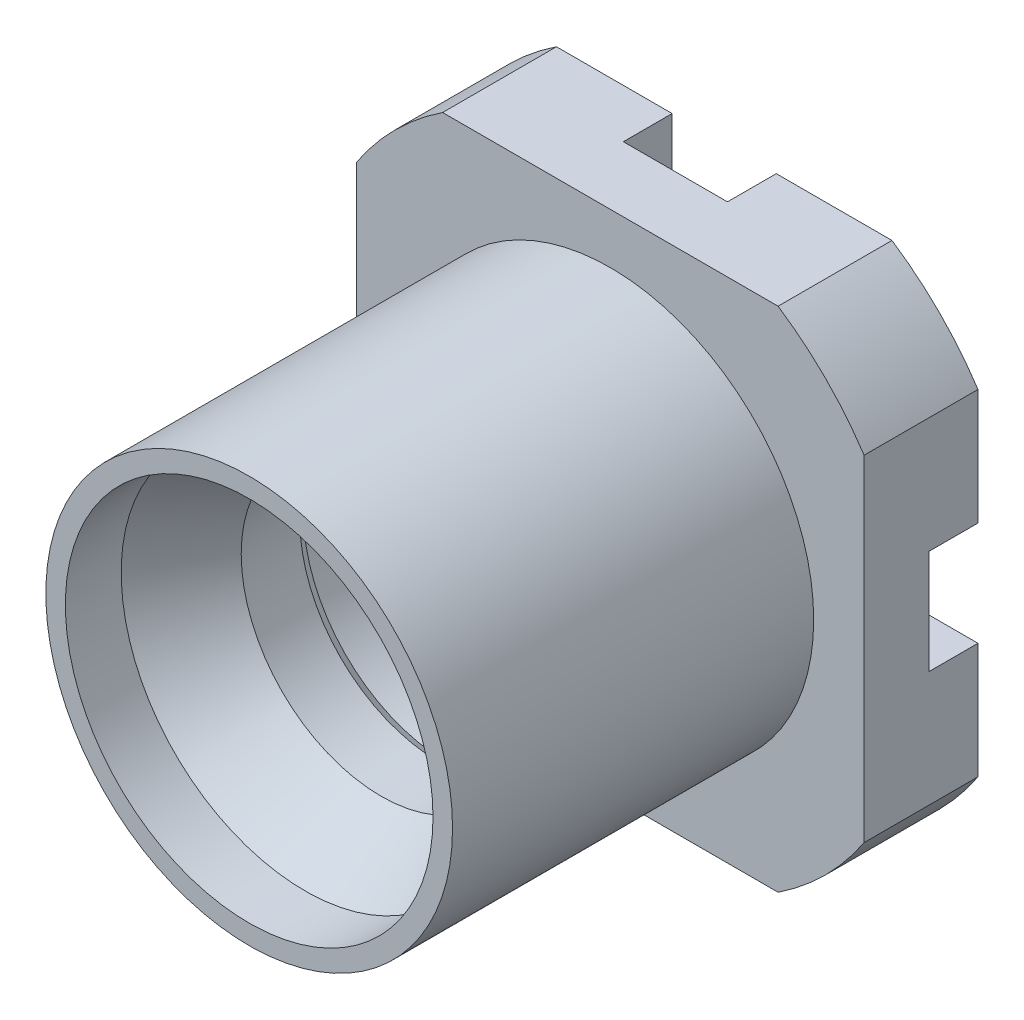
ISO-10303-21;
HEADER;
FILE_DESCRIPTION(('STEP AP214'),'2;1');
FILE_NAME('part.step','',(''),(''),'','','');
FILE_SCHEMA(('AUTOMOTIVE_DESIGN { 1 0 10303 214 1 1 1 1 }'));
ENDSEC;
DATA;
#1=APPLICATION_CONTEXT('core data for automotive mechanical design processes');
#2=APPLICATION_PROTOCOL_DEFINITION('international standard','automotive_design',2000,#1);
#3=PRODUCT_CONTEXT('',#1,'mechanical');
#4=PRODUCT('Part','Part','',(#3));
#5=PRODUCT_RELATED_PRODUCT_CATEGORY('part','',(#4));
#6=PRODUCT_DEFINITION_FORMATION('','',#4);
#7=PRODUCT_DEFINITION_CONTEXT('part definition',#1,'design');
#8=PRODUCT_DEFINITION('design','',#6,#7);
#9=PRODUCT_DEFINITION_SHAPE('','',#8);
#10=(LENGTH_UNIT() NAMED_UNIT(*) SI_UNIT(.MILLI.,.METRE.));
#11=(NAMED_UNIT(*) PLANE_ANGLE_UNIT() SI_UNIT($,.RADIAN.));
#12=(NAMED_UNIT(*) SI_UNIT($,.STERADIAN.) SOLID_ANGLE_UNIT());
#13=UNCERTAINTY_MEASURE_WITH_UNIT(LENGTH_MEASURE(1.E-05),#10,'distance_accuracy_value','');
#14=(GEOMETRIC_REPRESENTATION_CONTEXT(3) GLOBAL_UNCERTAINTY_ASSIGNED_CONTEXT((#13)) GLOBAL_UNIT_ASSIGNED_CONTEXT((#10,
#11,#12)) REPRESENTATION_CONTEXT('',''));
#15=CARTESIAN_POINT('',(0.,0.,0.));
#16=DIRECTION('',(0.,0.,1.));
#17=DIRECTION('',(1.,0.,0.));
#18=AXIS2_PLACEMENT_3D('',#15,#16,#17);
#19=CARTESIAN_POINT('',(-3.86493853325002,-0.419389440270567,-0.0934486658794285));
#20=CARTESIAN_POINT('',(-3.56013853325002,-0.419389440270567,-0.0934486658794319));
#21=CARTESIAN_POINT('',(-3.56013853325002,-0.419389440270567,-0.398248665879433));
#22=CARTESIAN_POINT('',(-3.86493853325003,-0.419389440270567,-0.398248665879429));
#23=(BOUNDED_CURVE() B_SPLINE_CURVE(3,(#19,#20,#21,#22),.UNSPECIFIED.,.F.,
.F.) B_SPLINE_CURVE_WITH_KNOTS((4,4),(0.,1.),
.UNSPECIFIED.) CURVE() GEOMETRIC_REPRESENTATION_ITEM() RATIONAL_B_SPLINE_CURVE((1.,
0.333333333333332,0.333333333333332,1.)) REPRESENTATION_ITEM(''));
#24=CARTESIAN_POINT('',(-3.8649385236,-0.4193894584,-0.2458486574));
#25=DIRECTION('',(0.,0.,1.));
#26=AXIS1_PLACEMENT('',#24,#25);
#27=SURFACE_OF_REVOLUTION('',#23,#26);
#28=CARTESIAN_POINT('',(-3.86493853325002,-0.419389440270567,-0.0934486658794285));
#29=VERTEX_POINT('',#28);
#30=VERTEX_LOOP('',#29);
#31=FACE_BOUND('',#30,.T.);
#32=CARTESIAN_POINT('',(-3.8649385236,-0.4193894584,-0.245848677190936));
#33=DIRECTION('',(0.,0.,-1.));
#34=DIRECTION('',(-1.,0.,0.));
#35=AXIS2_PLACEMENT_3D('',#32,#33,#34);
#36=CIRCLE('',#35,0.1524);
#37=CARTESIAN_POINT('',(-4.0173385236,-0.4193894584,-0.245848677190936));
#38=VERTEX_POINT('',#37);
#39=EDGE_CURVE('E237',#38,#38,#36,.T.);
#40=ORIENTED_EDGE('',*,*,#39,.F.);
#41=EDGE_LOOP('',(#40));
#42=FACE_BOUND('',#41,.T.);
#43=ADVANCED_FACE('F16',(#31,#42),#27,.F.);
#44=CARTESIAN_POINT('',(-3.8649385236,-0.4193894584,-1.0967486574));
#45=DIRECTION('',(0.,0.,-1.));
#46=DIRECTION('',(-1.,0.,0.));
#47=AXIS2_PLACEMENT_3D('',#44,#45,#46);
#48=CYLINDRICAL_SURFACE('',#47,0.1524);
#49=ORIENTED_EDGE('',*,*,#39,.T.);
#50=EDGE_LOOP('',(#49));
#51=FACE_BOUND('',#50,.T.);
#52=CARTESIAN_POINT('',(-3.8649385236,-0.4193894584,-1.0967486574));
#53=DIRECTION('',(0.,0.,-1.));
#54=DIRECTION('',(-1.,0.,0.));
#55=AXIS2_PLACEMENT_3D('',#52,#53,#54);
#56=CIRCLE('',#55,0.1524);
#57=CARTESIAN_POINT('',(-4.0173385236,-0.4193894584,-1.0967486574));
#58=VERTEX_POINT('',#57);
#59=EDGE_CURVE('E20',#58,#58,#56,.T.);
#60=ORIENTED_EDGE('',*,*,#59,.F.);
#61=EDGE_LOOP('',(#60));
#62=FACE_BOUND('',#61,.T.);
#63=ADVANCED_FACE('F971',(#51,#62),#48,.T.);
#64=CARTESIAN_POINT('',(-3.8649385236,-0.2669894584,-1.0967486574));
#65=DIRECTION('',(0.,0.,-1.));
#66=DIRECTION('',(-1.,0.,0.));
#67=AXIS2_PLACEMENT_3D('',#64,#65,#66);
#68=PLANE('',#67);
#69=ORIENTED_EDGE('',*,*,#59,.T.);
#70=EDGE_LOOP('',(#69));
#71=FACE_BOUND('',#70,.T.);
#72=CARTESIAN_POINT('',(-3.8649385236,-0.4193894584,-1.0967486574));
#73=DIRECTION('',(0.,0.,1.));
#74=DIRECTION('',(1.,0.,0.));
#75=AXIS2_PLACEMENT_3D('',#72,#73,#74);
#76=CIRCLE('',#75,0.5334);
#77=CARTESIAN_POINT('',(-3.3315385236,-0.4193894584,-1.0967486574));
#78=VERTEX_POINT('',#77);
#79=EDGE_CURVE('E232',#78,#78,#76,.F.);
#80=ORIENTED_EDGE('',*,*,#79,.F.);
#81=EDGE_LOOP('',(#80));
#82=FACE_BOUND('',#81,.T.);
#83=ADVANCED_FACE('F460',(#71,#82),#68,.F.);
#84=CARTESIAN_POINT('',(-3.8649385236,-0.4193894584,-1.0967486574));
#85=DIRECTION('',(0.,0.,1.));
#86=DIRECTION('',(1.,0.,0.));
#87=AXIS2_PLACEMENT_3D('',#84,#85,#86);
#88=CONICAL_SURFACE('',#87,0.5334,0.785398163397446);
#89=ORIENTED_EDGE('',*,*,#79,.T.);
#90=EDGE_LOOP('',(#89));
#91=FACE_BOUND('',#90,.T.);
#92=CARTESIAN_POINT('',(-3.8649385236,-0.4193894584,-1.04594866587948));
#93=DIRECTION('',(0.,0.,1.));
#94=DIRECTION('',(1.,0.,0.));
#95=AXIS2_PLACEMENT_3D('',#92,#93,#94);
#96=CIRCLE('',#95,0.584199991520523);
#97=CARTESIAN_POINT('',(-3.28073853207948,-0.4193894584,-1.04594866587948));
#98=VERTEX_POINT('',#97);
#99=EDGE_CURVE('E230',#98,#98,#96,.F.);
#100=ORIENTED_EDGE('',*,*,#99,.F.);
#101=EDGE_LOOP('',(#100));
#102=FACE_BOUND('',#101,.T.);
#103=ADVANCED_FACE('F453',(#91,#102),#88,.F.);
#104=CARTESIAN_POINT('',(-3.8649385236,0.6855105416,-1.0459486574));
#105=DIRECTION('',(0.,0.,-1.));
#106=DIRECTION('',(-1.,0.,0.));
#107=AXIS2_PLACEMENT_3D('',#104,#105,#106);
#108=PLANE('',#107);
#109=ORIENTED_EDGE('',*,*,#99,.T.);
#110=EDGE_LOOP('',(#109));
#111=FACE_BOUND('',#110,.T.);
#112=CARTESIAN_POINT('',(-3.8649385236,-0.4193894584,-1.0459486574));
#113=DIRECTION('',(0.,0.,-1.));
#114=DIRECTION('',(-1.,0.,0.));
#115=AXIS2_PLACEMENT_3D('',#112,#113,#114);
#116=CIRCLE('',#115,1.1303);
#117=CARTESIAN_POINT('',(-4.9952385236,-0.4193894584,-1.0459486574));
#118=VERTEX_POINT('',#117);
#119=EDGE_CURVE('E226',#118,#118,#116,.T.);
#120=ORIENTED_EDGE('',*,*,#119,.F.);
#121=EDGE_LOOP('',(#120));
#122=FACE_BOUND('',#121,.T.);
#123=ADVANCED_FACE('F448',(#111,#122),#108,.F.);
#124=CARTESIAN_POINT('',(-3.8649385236,-0.4193894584,-0.491107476));
#125=DIRECTION('',(0.,0.,-1.));
#126=DIRECTION('',(-1.,0.,0.));
#127=AXIS2_PLACEMENT_3D('',#124,#125,#126);
#128=CYLINDRICAL_SURFACE('',#127,1.1303);
#129=CARTESIAN_POINT('',(-3.8649385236,-0.4193894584,-0.491107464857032));
#130=DIRECTION('',(0.,0.,-1.));
#131=DIRECTION('',(-1.,0.,0.));
#132=AXIS2_PLACEMENT_3D('',#129,#130,#131);
#133=CIRCLE('',#132,1.13029999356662);
#134=CARTESIAN_POINT('',(-4.99523851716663,-0.4193894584,-0.491107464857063));
#135=VERTEX_POINT('',#134);
#136=EDGE_CURVE('E229',#135,#135,#133,.T.);
#137=ORIENTED_EDGE('',*,*,#136,.F.);
#138=EDGE_LOOP('',(#137));
#139=FACE_BOUND('',#138,.T.);
#140=ORIENTED_EDGE('',*,*,#119,.T.);
#141=EDGE_LOOP('',(#140));
#142=FACE_BOUND('',#141,.T.);
#143=ADVANCED_FACE('F445',(#139,#142),#128,.F.);
#144=CARTESIAN_POINT('',(-3.8649385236,-0.4193894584,-0.4251163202));
#145=DIRECTION('',(0.,0.,-1.));
#146=DIRECTION('',(0.,1.,0.));
#147=AXIS2_PLACEMENT_3D('',#144,#145,#146);
#148=CONICAL_SURFACE('',#147,1.0922,0.523598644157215);
#149=CARTESIAN_POINT('',(-3.8649385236,-0.4193894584,-0.425116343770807));
#150=DIRECTION('',(0.,0.,-1.));
#151=DIRECTION('',(-1.,0.,0.));
#152=AXIS2_PLACEMENT_3D('',#149,#150,#151);
#153=CIRCLE('',#152,1.0922);
#154=CARTESIAN_POINT('',(-4.9571385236,-0.4193894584,-0.425116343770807));
#155=VERTEX_POINT('',#154);
#156=EDGE_CURVE('E434',#155,#155,#153,.T.);
#157=ORIENTED_EDGE('',*,*,#156,.F.);
#158=EDGE_LOOP('',(#157));
#159=FACE_BOUND('',#158,.T.);
#160=ORIENTED_EDGE('',*,*,#136,.T.);
#161=EDGE_LOOP('',(#160));
#162=FACE_BOUND('',#161,.T.);
#163=ADVANCED_FACE('F443',(#159,#162),#148,.F.);
#164=CARTESIAN_POINT('',(-3.8649385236,-0.4193894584,0.032381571));
#165=DIRECTION('',(0.,0.,-1.));
#166=DIRECTION('',(0.,1.,0.));
#167=AXIS2_PLACEMENT_3D('',#164,#165,#166);
#168=CYLINDRICAL_SURFACE('',#167,1.0922);
#169=ORIENTED_EDGE('',*,*,#156,.T.);
#170=EDGE_LOOP('',(#169));
#171=FACE_BOUND('',#170,.T.);
#172=CARTESIAN_POINT('',(-3.8649385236,-0.4193894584,0.0323815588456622));
#173=DIRECTION('',(0.,0.,1.));
#174=DIRECTION('',(1.,0.,0.));
#175=AXIS2_PLACEMENT_3D('',#172,#173,#174);
#176=CIRCLE('',#175,1.09219999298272);
#177=CARTESIAN_POINT('',(-2.77273853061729,-0.4193894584,0.0323815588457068));
#178=VERTEX_POINT('',#177);
#179=EDGE_CURVE('E429',#178,#178,#176,.F.);
#180=ORIENTED_EDGE('',*,*,#179,.F.);
#181=EDGE_LOOP('',(#180));
#182=FACE_BOUND('',#181,.T.);
#183=ADVANCED_FACE('F592',(#171,#182),#168,.F.);
#184=CARTESIAN_POINT('',(-3.8649385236,-0.4193894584,0.032381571));
#185=DIRECTION('',(0.,0.,1.));
#186=DIRECTION('',(0.,-1.,0.));
#187=AXIS2_PLACEMENT_3D('',#184,#185,#186);
#188=CONICAL_SURFACE('',#187,1.0922,0.523598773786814);
#189=ORIENTED_EDGE('',*,*,#179,.T.);
#190=EDGE_LOOP('',(#189));
#191=FACE_BOUND('',#190,.T.);
#192=CARTESIAN_POINT('',(-3.8649385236,-0.4193894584,0.62630177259));
#193=DIRECTION('',(0.,0.,1.));
#194=DIRECTION('',(1.,0.,0.));
#195=AXIS2_PLACEMENT_3D('',#192,#193,#194);
#196=CIRCLE('',#195,1.4351);
#197=CARTESIAN_POINT('',(-2.4298385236,-0.4193894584,0.62630177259));
#198=VERTEX_POINT('',#197);
#199=EDGE_CURVE('E225',#198,#198,#196,.F.);
#200=ORIENTED_EDGE('',*,*,#199,.F.);
#201=EDGE_LOOP('',(#200));
#202=FACE_BOUND('',#201,.T.);
#203=ADVANCED_FACE('F588',(#191,#202),#188,.F.);
#204=CARTESIAN_POINT('',(-3.8649385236,-0.4193894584,0.6263017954));
#205=DIRECTION('',(0.,0.,1.));
#206=DIRECTION('',(1.,0.,0.));
#207=AXIS2_PLACEMENT_3D('',#204,#205,#206);
#208=CYLINDRICAL_SURFACE('',#207,1.4351);
#209=ORIENTED_EDGE('',*,*,#199,.T.);
#210=EDGE_LOOP('',(#209));
#211=FACE_BOUND('',#210,.T.);
#212=CARTESIAN_POINT('',(-3.8649385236,-0.4193894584,1.0622513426));
#213=DIRECTION('',(0.,0.,1.));
#214=DIRECTION('',(1.,0.,0.));
#215=AXIS2_PLACEMENT_3D('',#212,#213,#214);
#216=CIRCLE('',#215,1.4351);
#217=CARTESIAN_POINT('',(-2.4298385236,-0.4193894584,1.0622513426));
#218=VERTEX_POINT('',#217);
#219=EDGE_CURVE('E221',#218,#218,#216,.F.);
#220=ORIENTED_EDGE('',*,*,#219,.F.);
#221=EDGE_LOOP('',(#220));
#222=FACE_BOUND('',#221,.T.);
#223=ADVANCED_FACE('F584',(#211,#222),#208,.F.);
#224=CARTESIAN_POINT('',(-3.8649385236,1.0157105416,1.0622513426));
#225=DIRECTION('',(0.,0.,-1.));
#226=DIRECTION('',(-1.,0.,0.));
#227=AXIS2_PLACEMENT_3D('',#224,#225,#226);
#228=PLANE('',#227);
#229=ORIENTED_EDGE('',*,*,#219,.T.);
#230=EDGE_LOOP('',(#229));
#231=FACE_BOUND('',#230,.T.);
#232=CARTESIAN_POINT('',(-3.8649385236,-0.4193894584,1.0622513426));
#233=DIRECTION('',(0.,0.,1.));
#234=DIRECTION('',(1.,0.,0.));
#235=AXIS2_PLACEMENT_3D('',#232,#233,#234);
#236=CIRCLE('',#235,1.5875);
#237=CARTESIAN_POINT('',(-2.2774385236,-0.4193894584,1.0622513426));
#238=VERTEX_POINT('',#237);
#239=EDGE_CURVE('E217',#238,#238,#236,.F.);
#240=ORIENTED_EDGE('',*,*,#239,.F.);
#241=EDGE_LOOP('',(#240));
#242=FACE_BOUND('',#241,.T.);
#243=ADVANCED_FACE('F580',(#231,#242),#228,.F.);
#244=CARTESIAN_POINT('',(-4.0554385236,-0.2318767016,-2.5826486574));
#245=DIRECTION('',(0.,0.,1.));
#246=DIRECTION('',(1.,0.,0.));
#247=AXIS2_PLACEMENT_3D('',#244,#245,#246);
#248=PLANE('',#247);
#249=CARTESIAN_POINT('',(-3.8649385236,-0.4193894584,-2.58264867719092));
#250=DIRECTION('',(0.,0.,-1.));
#251=DIRECTION('',(-1.,0.,0.));
#252=AXIS2_PLACEMENT_3D('',#249,#250,#251);
#253=CIRCLE('',#252,0.1524);
#254=CARTESIAN_POINT('',(-4.0173385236,-0.4193894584,-2.58264867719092));
#255=VERTEX_POINT('',#254);
#256=EDGE_CURVE('E209',#255,#255,#253,.F.);
#257=ORIENTED_EDGE('',*,*,#256,.F.);
#258=EDGE_LOOP('',(#257));
#259=FACE_BOUND('',#258,.T.);
#260=ADVANCED_FACE('F576',(#259),#248,.F.);
#261=CARTESIAN_POINT('',(-3.8649385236,-0.4193894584,-1.7571486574));
#262=DIRECTION('',(0.,0.,1.));
#263=DIRECTION('',(0.,-1.,0.));
#264=AXIS2_PLACEMENT_3D('',#261,#262,#263);
#265=CYLINDRICAL_SURFACE('',#264,2.3749);
#266=CARTESIAN_POINT('',(-3.8649385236,-0.4193894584,-2.64614867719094));
#267=DIRECTION('',(0.,0.,1.));
#268=DIRECTION('',(0.,-1.,0.));
#269=AXIS2_PLACEMENT_3D('',#266,#267,#268);
#270=CIRCLE('',#269,2.3749);
#271=CARTESIAN_POINT('',(-1.8837385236,-1.72896822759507,-2.64614866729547));
#272=VERTEX_POINT('',#271);
#273=CARTESIAN_POINT('',(-2.55535975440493,-2.4005894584,-2.64614866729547));
#274=VERTEX_POINT('',#273);
#275=EDGE_CURVE('E213',#272,#274,#270,.F.);
#276=ORIENTED_EDGE('',*,*,#275,.F.);
#277=DIRECTION('',(0.,0.,1.));
#278=VECTOR('',#277,1.);
#279=CARTESIAN_POINT('',(-1.8837385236,-1.728968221,-2.2651486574));
#280=LINE('',#279,#278);
#281=CARTESIAN_POINT('',(-1.8837385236,-1.72896822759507,-1.75714866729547));
#282=VERTEX_POINT('',#281);
#283=EDGE_CURVE('E224',#282,#272,#280,.F.);
#284=ORIENTED_EDGE('',*,*,#283,.F.);
#285=CARTESIAN_POINT('',(-3.8649385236,-0.4193894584,-1.75714867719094));
#286=DIRECTION('',(0.,0.,1.));
#287=DIRECTION('',(0.,-1.,0.));
#288=AXIS2_PLACEMENT_3D('',#285,#286,#287);
#289=CIRCLE('',#288,2.3749);
#290=CARTESIAN_POINT('',(-2.55535975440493,-2.4005894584,-1.75714866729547));
#291=VERTEX_POINT('',#290);
#292=EDGE_CURVE('E318',#291,#282,#289,.T.);
#293=ORIENTED_EDGE('',*,*,#292,.F.);
#294=DIRECTION('',(0.,0.,1.));
#295=VECTOR('',#294,1.);
#296=CARTESIAN_POINT('',(-2.555359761,-2.4005894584,-2.2651486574));
#297=LINE('',#296,#295);
#298=EDGE_CURVE('E220',#274,#291,#297,.T.);
#299=ORIENTED_EDGE('',*,*,#298,.F.);
#300=EDGE_LOOP('',(#276,#284,#293,#299));
#301=FACE_BOUND('',#300,.T.);
#302=ADVANCED_FACE('F573',(#301),#265,.T.);
#303=CARTESIAN_POINT('',(-1.8837385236,0.8901893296,-2.2651486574));
#304=DIRECTION('',(-1.,0.,0.));
#305=DIRECTION('',(0.,0.,1.));
#306=AXIS2_PLACEMENT_3D('',#303,#304,#305);
#307=PLANE('',#306);
#308=DIRECTION('',(0.,1.,0.));
#309=VECTOR('',#308,1.);
#310=CARTESIAN_POINT('',(-1.8837385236,-0.4193894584,-2.6461486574));
#311=LINE('',#310,#309);
#312=CARTESIAN_POINT('',(-1.88373852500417,0.890189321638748,-2.64614866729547));
#313=VERTEX_POINT('',#312);
#314=CARTESIAN_POINT('',(-1.8837385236,-0.0129894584,-2.6461486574));
#315=VERTEX_POINT('',#314);
#316=EDGE_CURVE('E197',#313,#315,#311,.F.);
#317=ORIENTED_EDGE('',*,*,#316,.F.);
#318=DIRECTION('',(0.,0.,-1.));
#319=VECTOR('',#318,1.);
#320=CARTESIAN_POINT('',(-1.88373852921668,0.890189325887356,-2.2016486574));
#321=LINE('',#320,#319);
#322=CARTESIAN_POINT('',(-1.88373852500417,0.890189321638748,-1.75714866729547));
#323=VERTEX_POINT('',#322);
#324=EDGE_CURVE('E183',#323,#313,#321,.T.);
#325=ORIENTED_EDGE('',*,*,#324,.F.);
#326=DIRECTION('',(0.,1.,0.));
#327=VECTOR('',#326,1.);
#328=CARTESIAN_POINT('',(-1.8837385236,-0.4193894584,-1.7571486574));
#329=LINE('',#328,#327);
#330=EDGE_CURVE('E317',#282,#323,#329,.T.);
#331=ORIENTED_EDGE('',*,*,#330,.F.);
#332=ORIENTED_EDGE('',*,*,#283,.T.);
#333=DIRECTION('',(0.,1.,0.));
#334=VECTOR('',#333,1.);
#335=CARTESIAN_POINT('',(-1.8837385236,-0.4193894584,-2.6461486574));
#336=LINE('',#335,#334);
#337=CARTESIAN_POINT('',(-1.8837385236,-0.8257894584,-2.6461486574));
#338=VERTEX_POINT('',#337);
#339=EDGE_CURVE('E203',#338,#272,#336,.F.);
#340=ORIENTED_EDGE('',*,*,#339,.F.);
#341=DIRECTION('',(0.,0.,1.));
#342=VECTOR('',#341,1.);
#343=CARTESIAN_POINT('',(-1.8837385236,-0.825789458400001,-2.2651486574));
#344=LINE('',#343,#342);
#345=CARTESIAN_POINT('',(-1.8837385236,-0.825789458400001,-2.2651486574));
#346=VERTEX_POINT('',#345);
#347=EDGE_CURVE('E380',#338,#346,#344,.T.);
#348=ORIENTED_EDGE('',*,*,#347,.T.);
#349=DIRECTION('',(0.,1.,0.));
#350=VECTOR('',#349,1.);
#351=CARTESIAN_POINT('',(-1.8837385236,0.8901893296,-2.2651486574));
#352=LINE('',#351,#350);
#353=CARTESIAN_POINT('',(-1.8837385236,-0.0129894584,-2.2651486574));
#354=VERTEX_POINT('',#353);
#355=EDGE_CURVE('E387',#346,#354,#352,.T.);
#356=ORIENTED_EDGE('',*,*,#355,.T.);
#357=DIRECTION('',(0.,0.,1.));
#358=VECTOR('',#357,1.);
#359=CARTESIAN_POINT('',(-1.8837385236,-0.0129894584,-2.2651486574));
#360=LINE('',#359,#358);
#361=EDGE_CURVE('E194',#354,#315,#360,.F.);
#362=ORIENTED_EDGE('',*,*,#361,.T.);
#363=EDGE_LOOP('',(#317,#325,#331,#332,#340,#348,#356,#362));
#364=FACE_BOUND('',#363,.T.);
#365=ADVANCED_FACE('F198',(#364),#307,.F.);
#366=CARTESIAN_POINT('',(-3.8649385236,-0.4193894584,-1.7571486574));
#367=DIRECTION('',(0.,0.,1.));
#368=DIRECTION('',(0.,-1.,0.));
#369=AXIS2_PLACEMENT_3D('',#366,#367,#368);
#370=CYLINDRICAL_SURFACE('',#369,2.3749);
#371=CARTESIAN_POINT('',(-3.8649385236,-0.4193894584,-2.64614867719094));
#372=DIRECTION('',(0.,0.,1.));
#373=DIRECTION('',(0.,-1.,0.));
#374=AXIS2_PLACEMENT_3D('',#371,#372,#373);
#375=CIRCLE('',#374,2.3749);
#376=CARTESIAN_POINT('',(-2.55535975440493,1.5618105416,-2.64614866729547));
#377=VERTEX_POINT('',#376);
#378=EDGE_CURVE('E187',#377,#313,#375,.F.);
#379=ORIENTED_EDGE('',*,*,#378,.F.);
#380=DIRECTION('',(0.,0.,-1.));
#381=VECTOR('',#380,1.);
#382=CARTESIAN_POINT('',(-2.555359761,1.5618105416,-2.2651486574));
#383=LINE('',#382,#381);
#384=CARTESIAN_POINT('',(-2.55535975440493,1.5618105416,-1.75714866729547));
#385=VERTEX_POINT('',#384);
#386=EDGE_CURVE('E178',#385,#377,#383,.T.);
#387=ORIENTED_EDGE('',*,*,#386,.F.);
#388=CARTESIAN_POINT('',(-3.8649385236,-0.4193894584,-1.75714867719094));
#389=DIRECTION('',(0.,0.,1.));
#390=DIRECTION('',(0.,-1.,0.));
#391=AXIS2_PLACEMENT_3D('',#388,#389,#390);
#392=CIRCLE('',#391,2.3749);
#393=EDGE_CURVE('E190',#323,#385,#392,.T.);
#394=ORIENTED_EDGE('',*,*,#393,.F.);
#395=ORIENTED_EDGE('',*,*,#324,.T.);
#396=EDGE_LOOP('',(#379,#387,#394,#395));
#397=FACE_BOUND('',#396,.T.);
#398=ADVANCED_FACE('F185',(#397),#370,.T.);
#399=CARTESIAN_POINT('',(-2.555359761,1.5618105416,-2.2651486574));
#400=DIRECTION('',(0.,-1.,0.));
#401=DIRECTION('',(0.,0.,-1.));
#402=AXIS2_PLACEMENT_3D('',#399,#400,#401);
#403=PLANE('',#402);
#404=DIRECTION('',(1.,0.,0.));
#405=VECTOR('',#404,1.);
#406=CARTESIAN_POINT('',(-2.555359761,1.5618105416,-2.6461486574));
#407=LINE('',#406,#405);
#408=CARTESIAN_POINT('',(-4.2713385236,1.5618105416,-2.6461486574));
#409=VERTEX_POINT('',#408);
#410=CARTESIAN_POINT('',(-5.17451730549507,1.5618105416,-2.64614866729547));
#411=VERTEX_POINT('',#410);
#412=EDGE_CURVE('E377',#409,#411,#407,.F.);
#413=ORIENTED_EDGE('',*,*,#412,.T.);
#414=DIRECTION('',(0.,0.,-1.));
#415=VECTOR('',#414,1.);
#416=CARTESIAN_POINT('',(-5.1745173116,1.5618105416,-2.2651486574));
#417=LINE('',#416,#415);
#418=CARTESIAN_POINT('',(-5.17451730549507,1.5618105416,-1.75714866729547));
#419=VERTEX_POINT('',#418);
#420=EDGE_CURVE('E371',#411,#419,#417,.F.);
#421=ORIENTED_EDGE('',*,*,#420,.T.);
#422=DIRECTION('',(-1.,0.,0.));
#423=VECTOR('',#422,1.);
#424=CARTESIAN_POINT('',(-3.8649385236,1.5618105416,-1.7571486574));
#425=LINE('',#424,#423);
#426=EDGE_CURVE('E316',#385,#419,#425,.T.);
#427=ORIENTED_EDGE('',*,*,#426,.F.);
#428=ORIENTED_EDGE('',*,*,#386,.T.);
#429=DIRECTION('',(-1.,0.,0.));
#430=VECTOR('',#429,1.);
#431=CARTESIAN_POINT('',(-3.8649385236,1.5618105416,-2.6461486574));
#432=LINE('',#431,#430);
#433=CARTESIAN_POINT('',(-3.4585385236,1.5618105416,-2.6461486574));
#434=VERTEX_POINT('',#433);
#435=EDGE_CURVE('E207',#434,#377,#432,.F.);
#436=ORIENTED_EDGE('',*,*,#435,.F.);
#437=DIRECTION('',(0.,0.,-1.));
#438=VECTOR('',#437,1.);
#439=CARTESIAN_POINT('',(-3.4585385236,1.5618105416,-2.2651486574));
#440=LINE('',#439,#438);
#441=CARTESIAN_POINT('',(-3.4585385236,1.5618105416,-2.2651486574));
#442=VERTEX_POINT('',#441);
#443=EDGE_CURVE('E376',#434,#442,#440,.F.);
#444=ORIENTED_EDGE('',*,*,#443,.T.);
#445=DIRECTION('',(1.,0.,0.));
#446=VECTOR('',#445,1.);
#447=CARTESIAN_POINT('',(-2.555359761,1.5618105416,-2.2651486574));
#448=LINE('',#447,#446);
#449=CARTESIAN_POINT('',(-4.2713385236,1.5618105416,-2.2651486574));
#450=VERTEX_POINT('',#449);
#451=EDGE_CURVE('E395',#442,#450,#448,.F.);
#452=ORIENTED_EDGE('',*,*,#451,.T.);
#453=DIRECTION('',(0.,0.,-1.));
#454=VECTOR('',#453,1.);
#455=CARTESIAN_POINT('',(-4.2713385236,1.5618105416,-2.2651486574));
#456=LINE('',#455,#454);
#457=EDGE_CURVE('E413',#450,#409,#456,.T.);
#458=ORIENTED_EDGE('',*,*,#457,.T.);
#459=EDGE_LOOP('',(#413,#421,#427,#428,#436,#444,#452,#458));
#460=FACE_BOUND('',#459,.T.);
#461=ADVANCED_FACE('F565',(#460),#403,.F.);
#462=CARTESIAN_POINT('',(-2.555359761,-2.4005894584,-2.2651486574));
#463=DIRECTION('',(0.,1.,0.));
#464=DIRECTION('',(0.,0.,1.));
#465=AXIS2_PLACEMENT_3D('',#462,#463,#464);
#466=PLANE('',#465);
#467=DIRECTION('',(1.,0.,0.));
#468=VECTOR('',#467,1.);
#469=CARTESIAN_POINT('',(-3.8649385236,-2.4005894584,-2.6461486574));
#470=LINE('',#469,#468);
#471=CARTESIAN_POINT('',(-3.4585385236,-2.4005894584,-2.6461486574));
#472=VERTEX_POINT('',#471);
#473=EDGE_CURVE('E320',#274,#472,#470,.F.);
#474=ORIENTED_EDGE('',*,*,#473,.F.);
#475=ORIENTED_EDGE('',*,*,#298,.T.);
#476=DIRECTION('',(-1.,0.,0.));
#477=VECTOR('',#476,1.);
#478=CARTESIAN_POINT('',(-3.8649385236,-2.4005894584,-1.7571486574));
#479=LINE('',#478,#477);
#480=CARTESIAN_POINT('',(-5.17451730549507,-2.4005894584,-1.75714866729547));
#481=VERTEX_POINT('',#480);
#482=EDGE_CURVE('E315',#481,#291,#479,.F.);
#483=ORIENTED_EDGE('',*,*,#482,.F.);
#484=DIRECTION('',(0.,0.,1.));
#485=VECTOR('',#484,1.);
#486=CARTESIAN_POINT('',(-5.1745173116,-2.4005894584,-2.2651486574));
#487=LINE('',#486,#485);
#488=CARTESIAN_POINT('',(-5.17451730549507,-2.4005894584,-2.64614866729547));
#489=VERTEX_POINT('',#488);
#490=EDGE_CURVE('E367',#481,#489,#487,.F.);
#491=ORIENTED_EDGE('',*,*,#490,.T.);
#492=DIRECTION('',(1.,0.,0.));
#493=VECTOR('',#492,1.);
#494=CARTESIAN_POINT('',(-2.555359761,-2.4005894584,-2.6461486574));
#495=LINE('',#494,#493);
#496=CARTESIAN_POINT('',(-4.2713385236,-2.4005894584,-2.6461486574));
#497=VERTEX_POINT('',#496);
#498=EDGE_CURVE('E370',#489,#497,#495,.T.);
#499=ORIENTED_EDGE('',*,*,#498,.T.);
#500=DIRECTION('',(0.,0.,1.));
#501=VECTOR('',#500,1.);
#502=CARTESIAN_POINT('',(-4.2713385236,-2.4005894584,-2.2651486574));
#503=LINE('',#502,#501);
#504=CARTESIAN_POINT('',(-4.2713385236,-2.4005894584,-2.2651486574));
#505=VERTEX_POINT('',#504);
#506=EDGE_CURVE('E400',#497,#505,#503,.T.);
#507=ORIENTED_EDGE('',*,*,#506,.T.);
#508=DIRECTION('',(1.,0.,0.));
#509=VECTOR('',#508,1.);
#510=CARTESIAN_POINT('',(-2.555359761,-2.4005894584,-2.2651486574));
#511=LINE('',#510,#509);
#512=CARTESIAN_POINT('',(-3.4585385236,-2.4005894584,-2.2651486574));
#513=VERTEX_POINT('',#512);
#514=EDGE_CURVE('E382',#505,#513,#511,.T.);
#515=ORIENTED_EDGE('',*,*,#514,.T.);
#516=DIRECTION('',(0.,0.,1.));
#517=VECTOR('',#516,1.);
#518=CARTESIAN_POINT('',(-3.4585385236,-2.4005894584,-2.2651486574));
#519=LINE('',#518,#517);
#520=EDGE_CURVE('E374',#513,#472,#519,.F.);
#521=ORIENTED_EDGE('',*,*,#520,.T.);
#522=EDGE_LOOP('',(#474,#475,#483,#491,#499,#507,#515,#521));
#523=FACE_BOUND('',#522,.T.);
#524=ADVANCED_FACE('F561',(#523),#466,.F.);
#525=CARTESIAN_POINT('',(-3.8649385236,-0.4193894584,1.0622513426));
#526=DIRECTION('',(0.,0.,1.));
#527=DIRECTION('',(1.,0.,0.));
#528=AXIS2_PLACEMENT_3D('',#525,#526,#527);
#529=CYLINDRICAL_SURFACE('',#528,1.5875);
#530=ORIENTED_EDGE('',*,*,#239,.T.);
#531=EDGE_LOOP('',(#530));
#532=FACE_BOUND('',#531,.T.);
#533=CARTESIAN_POINT('',(-3.8649385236,-0.4193894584,-1.75714867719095));
#534=DIRECTION('',(0.,0.,1.));
#535=DIRECTION('',(1.,0.,0.));
#536=AXIS2_PLACEMENT_3D('',#533,#534,#535);
#537=CIRCLE('',#536,1.5875);
#538=CARTESIAN_POINT('',(-2.2774385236,-0.4193894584,-1.75714867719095));
#539=VERTEX_POINT('',#538);
#540=EDGE_CURVE('E312',#539,#539,#537,.F.);
#541=ORIENTED_EDGE('',*,*,#540,.F.);
#542=EDGE_LOOP('',(#541));
#543=FACE_BOUND('',#542,.T.);
#544=ADVANCED_FACE('F557',(#532,#543),#529,.T.);
#545=CARTESIAN_POINT('',(-3.8649385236,-0.4193894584,-2.5826486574));
#546=DIRECTION('',(0.,0.,-1.));
#547=DIRECTION('',(-1.,0.,0.));
#548=AXIS2_PLACEMENT_3D('',#545,#546,#547);
#549=CYLINDRICAL_SURFACE('',#548,0.1524);
#550=ORIENTED_EDGE('',*,*,#256,.T.);
#551=EDGE_LOOP('',(#550));
#552=FACE_BOUND('',#551,.T.);
#553=CARTESIAN_POINT('',(-3.8649385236,-0.4193894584,-2.2143486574));
#554=DIRECTION('',(0.,0.,-1.));
#555=DIRECTION('',(-1.,0.,0.));
#556=AXIS2_PLACEMENT_3D('',#553,#554,#555);
#557=CIRCLE('',#556,0.1524);
#558=CARTESIAN_POINT('',(-4.0173385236,-0.4193894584,-2.2143486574));
#559=VERTEX_POINT('',#558);
#560=EDGE_CURVE('E296',#559,#559,#557,.F.);
#561=ORIENTED_EDGE('',*,*,#560,.F.);
#562=EDGE_LOOP('',(#561));
#563=FACE_BOUND('',#562,.T.);
#564=ADVANCED_FACE('F554',(#552,#563),#549,.T.);
#565=CARTESIAN_POINT('',(-3.8649385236,-0.4193894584,-2.6461486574));
#566=DIRECTION('',(0.,0.,-1.));
#567=DIRECTION('',(-1.,0.,0.));
#568=AXIS2_PLACEMENT_3D('',#565,#566,#567);
#569=PLANE('',#568);
#570=ORIENTED_EDGE('',*,*,#316,.T.);
#571=DIRECTION('',(1.,0.,0.));
#572=VECTOR('',#571,1.);
#573=CARTESIAN_POINT('',(-3.4585385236,-0.0129894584,-2.6461486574));
#574=LINE('',#573,#572);
#575=CARTESIAN_POINT('',(-2.66171824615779,-0.0129894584,-2.64614866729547));
#576=VERTEX_POINT('',#575);
#577=EDGE_CURVE('E348',#576,#315,#574,.T.);
#578=ORIENTED_EDGE('',*,*,#577,.F.);
#579=CARTESIAN_POINT('',(-3.8649385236,-0.4193894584,-2.64614867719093));
#580=DIRECTION('',(0.,0.,-1.));
#581=DIRECTION('',(-1.,0.,0.));
#582=AXIS2_PLACEMENT_3D('',#579,#580,#581);
#583=CIRCLE('',#582,1.27);
#584=CARTESIAN_POINT('',(-3.45853852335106,0.783830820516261,-2.64614866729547));
#585=VERTEX_POINT('',#584);
#586=EDGE_CURVE('E288',#585,#576,#583,.T.);
#587=ORIENTED_EDGE('',*,*,#586,.F.);
#588=DIRECTION('',(0.,1.,0.));
#589=VECTOR('',#588,1.);
#590=CARTESIAN_POINT('',(-3.4585385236,1.5618105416,-2.6461486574));
#591=LINE('',#590,#589);
#592=EDGE_CURVE('E358',#434,#585,#591,.F.);
#593=ORIENTED_EDGE('',*,*,#592,.F.);
#594=ORIENTED_EDGE('',*,*,#435,.T.);
#595=ORIENTED_EDGE('',*,*,#378,.T.);
#596=EDGE_LOOP('',(#570,#578,#587,#593,#594,#595));
#597=FACE_BOUND('',#596,.T.);
#598=ADVANCED_FACE('F205',(#597),#569,.T.);
#599=CARTESIAN_POINT('',(-3.8649385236,-0.4193894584,-2.6461486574));
#600=DIRECTION('',(0.,0.,1.));
#601=DIRECTION('',(1.,0.,0.));
#602=AXIS2_PLACEMENT_3D('',#599,#600,#601);
#603=PLANE('',#602);
#604=ORIENTED_EDGE('',*,*,#275,.T.);
#605=ORIENTED_EDGE('',*,*,#473,.T.);
#606=DIRECTION('',(0.,1.,0.));
#607=VECTOR('',#606,1.);
#608=CARTESIAN_POINT('',(-3.4585385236,-2.4005894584,-2.6461486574));
#609=LINE('',#608,#607);
#610=CARTESIAN_POINT('',(-3.4585385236,-1.62260973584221,-2.6461486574));
#611=VERTEX_POINT('',#610);
#612=EDGE_CURVE('E341',#611,#472,#609,.F.);
#613=ORIENTED_EDGE('',*,*,#612,.F.);
#614=CARTESIAN_POINT('',(-3.8649385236,-0.4193894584,-2.6461486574));
#615=DIRECTION('',(0.,0.,-1.));
#616=DIRECTION('',(-1.,0.,0.));
#617=AXIS2_PLACEMENT_3D('',#614,#615,#616);
#618=CIRCLE('',#617,1.27);
#619=CARTESIAN_POINT('',(-2.66171824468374,-0.825789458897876,-2.6461486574));
#620=VERTEX_POINT('',#619);
#621=EDGE_CURVE('E284',#620,#611,#618,.T.);
#622=ORIENTED_EDGE('',*,*,#621,.F.);
#623=DIRECTION('',(1.,0.,0.));
#624=VECTOR('',#623,1.);
#625=CARTESIAN_POINT('',(-3.4585385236,-0.8257894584,-2.6461486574));
#626=LINE('',#625,#624);
#627=EDGE_CURVE('E346',#338,#620,#626,.F.);
#628=ORIENTED_EDGE('',*,*,#627,.F.);
#629=ORIENTED_EDGE('',*,*,#339,.T.);
#630=EDGE_LOOP('',(#604,#605,#613,#622,#628,#629));
#631=FACE_BOUND('',#630,.T.);
#632=ADVANCED_FACE('F548',(#631),#603,.F.);
#633=CARTESIAN_POINT('',(-3.8649385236,-0.4193894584,-1.7571486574));
#634=DIRECTION('',(0.,0.,-1.));
#635=DIRECTION('',(-1.,0.,0.));
#636=AXIS2_PLACEMENT_3D('',#633,#634,#635);
#637=PLANE('',#636);
#638=ORIENTED_EDGE('',*,*,#540,.T.);
#639=EDGE_LOOP('',(#638));
#640=FACE_BOUND('',#639,.T.);
#641=CARTESIAN_POINT('',(-3.8649385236,-0.4193894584,-1.75714867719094));
#642=DIRECTION('',(0.,0.,1.));
#643=DIRECTION('',(0.,-1.,0.));
#644=AXIS2_PLACEMENT_3D('',#641,#642,#643);
#645=CIRCLE('',#644,2.3749);
#646=CARTESIAN_POINT('',(-5.8461385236,-1.72896822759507,-1.75714866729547));
#647=VERTEX_POINT('',#646);
#648=EDGE_CURVE('E303',#481,#647,#645,.F.);
#649=ORIENTED_EDGE('',*,*,#648,.F.);
#650=ORIENTED_EDGE('',*,*,#482,.T.);
#651=ORIENTED_EDGE('',*,*,#292,.T.);
#652=ORIENTED_EDGE('',*,*,#330,.T.);
#653=ORIENTED_EDGE('',*,*,#393,.T.);
#654=ORIENTED_EDGE('',*,*,#426,.T.);
#655=CARTESIAN_POINT('',(-3.8649385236,-0.4193894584,-1.75714867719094));
#656=DIRECTION('',(0.,0.,1.));
#657=DIRECTION('',(0.,-1.,0.));
#658=AXIS2_PLACEMENT_3D('',#655,#656,#657);
#659=CIRCLE('',#658,2.3749);
#660=CARTESIAN_POINT('',(-5.8461385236,0.890189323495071,-1.75714866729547));
#661=VERTEX_POINT('',#660);
#662=EDGE_CURVE('E309',#661,#419,#659,.F.);
#663=ORIENTED_EDGE('',*,*,#662,.F.);
#664=DIRECTION('',(0.,1.,0.));
#665=VECTOR('',#664,1.);
#666=CARTESIAN_POINT('',(-5.8461385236,0.8901893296,-1.7571486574));
#667=LINE('',#666,#665);
#668=EDGE_CURVE('E615',#647,#661,#667,.T.);
#669=ORIENTED_EDGE('',*,*,#668,.F.);
#670=EDGE_LOOP('',(#649,#650,#651,#652,#653,#654,#663,#669));
#671=FACE_BOUND('',#670,.T.);
#672=ADVANCED_FACE('F544',(#640,#671),#637,.F.);
#673=CARTESIAN_POINT('',(-3.8649385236,-0.4193894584,-1.7571486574));
#674=DIRECTION('',(0.,0.,1.));
#675=DIRECTION('',(0.,-1.,0.));
#676=AXIS2_PLACEMENT_3D('',#673,#674,#675);
#677=CYLINDRICAL_SURFACE('',#676,2.3749);
#678=CARTESIAN_POINT('',(-3.8649385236,-0.4193894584,-2.64614867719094));
#679=DIRECTION('',(0.,0.,1.));
#680=DIRECTION('',(0.,-1.,0.));
#681=AXIS2_PLACEMENT_3D('',#678,#679,#680);
#682=CIRCLE('',#681,2.3749);
#683=CARTESIAN_POINT('',(-5.8461385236,0.890189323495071,-2.64614866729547));
#684=VERTEX_POINT('',#683);
#685=EDGE_CURVE('E306',#684,#411,#682,.F.);
#686=ORIENTED_EDGE('',*,*,#685,.F.);
#687=DIRECTION('',(0.,0.,-1.));
#688=VECTOR('',#687,1.);
#689=CARTESIAN_POINT('',(-5.8461385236,0.8901893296,-2.2651486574));
#690=LINE('',#689,#688);
#691=EDGE_CURVE('E641',#661,#684,#690,.T.);
#692=ORIENTED_EDGE('',*,*,#691,.F.);
#693=ORIENTED_EDGE('',*,*,#662,.T.);
#694=ORIENTED_EDGE('',*,*,#420,.F.);
#695=EDGE_LOOP('',(#686,#692,#693,#694));
#696=FACE_BOUND('',#695,.T.);
#697=ADVANCED_FACE('F540',(#696),#677,.T.);
#698=CARTESIAN_POINT('',(-3.8649385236,-0.4193894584,-2.6461486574));
#699=DIRECTION('',(0.,0.,1.));
#700=DIRECTION('',(1.,0.,0.));
#701=AXIS2_PLACEMENT_3D('',#698,#699,#700);
#702=PLANE('',#701);
#703=ORIENTED_EDGE('',*,*,#685,.T.);
#704=ORIENTED_EDGE('',*,*,#412,.F.);
#705=DIRECTION('',(0.,1.,0.));
#706=VECTOR('',#705,1.);
#707=CARTESIAN_POINT('',(-4.2713385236,1.5618105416,-2.6461486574));
#708=LINE('',#707,#706);
#709=CARTESIAN_POINT('',(-4.2713385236,0.783830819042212,-2.64614866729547));
#710=VERTEX_POINT('',#709);
#711=EDGE_CURVE('E360',#710,#409,#708,.T.);
#712=ORIENTED_EDGE('',*,*,#711,.F.);
#713=CARTESIAN_POINT('',(-3.8649385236,-0.4193894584,-2.64614867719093));
#714=DIRECTION('',(0.,0.,-1.));
#715=DIRECTION('',(-1.,0.,0.));
#716=AXIS2_PLACEMENT_3D('',#713,#714,#715);
#717=CIRCLE('',#716,1.27);
#718=CARTESIAN_POINT('',(-5.06815880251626,-0.0129894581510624,-2.64614866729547));
#719=VERTEX_POINT('',#718);
#720=EDGE_CURVE('E292',#719,#710,#717,.T.);
#721=ORIENTED_EDGE('',*,*,#720,.F.);
#722=DIRECTION('',(1.,0.,0.));
#723=VECTOR('',#722,1.);
#724=CARTESIAN_POINT('',(-4.2713385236,-0.0129894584,-2.6461486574));
#725=LINE('',#724,#723);
#726=CARTESIAN_POINT('',(-5.8461385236,-0.0129894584,-2.6461486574));
#727=VERTEX_POINT('',#726);
#728=EDGE_CURVE('E299',#727,#719,#725,.T.);
#729=ORIENTED_EDGE('',*,*,#728,.F.);
#730=DIRECTION('',(0.,1.,0.));
#731=VECTOR('',#730,1.);
#732=CARTESIAN_POINT('',(-5.8461385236,0.8901893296,-2.6461486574));
#733=LINE('',#732,#731);
#734=EDGE_CURVE('E637',#684,#727,#733,.F.);
#735=ORIENTED_EDGE('',*,*,#734,.F.);
#736=EDGE_LOOP('',(#703,#704,#712,#721,#729,#735));
#737=FACE_BOUND('',#736,.T.);
#738=ADVANCED_FACE('F536',(#737),#702,.F.);
#739=CARTESIAN_POINT('',(-3.8649385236,-0.4193894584,-2.6461486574));
#740=DIRECTION('',(0.,0.,-1.));
#741=DIRECTION('',(-1.,0.,0.));
#742=AXIS2_PLACEMENT_3D('',#739,#740,#741);
#743=PLANE('',#742);
#744=DIRECTION('',(0.,1.,0.));
#745=VECTOR('',#744,1.);
#746=CARTESIAN_POINT('',(-5.8461385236,0.8901893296,-2.6461486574));
#747=LINE('',#746,#745);
#748=CARTESIAN_POINT('',(-5.8461385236,-0.825789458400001,-2.6461486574));
#749=VERTEX_POINT('',#748);
#750=CARTESIAN_POINT('',(-5.8461385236,-1.72896822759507,-2.64614866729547));
#751=VERTEX_POINT('',#750);
#752=EDGE_CURVE('E621',#749,#751,#747,.F.);
#753=ORIENTED_EDGE('',*,*,#752,.F.);
#754=DIRECTION('',(1.,0.,0.));
#755=VECTOR('',#754,1.);
#756=CARTESIAN_POINT('',(-4.2713385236,-0.8257894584,-2.6461486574));
#757=LINE('',#756,#755);
#758=CARTESIAN_POINT('',(-5.06815880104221,-0.8257894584,-2.64614866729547));
#759=VERTEX_POINT('',#758);
#760=EDGE_CURVE('E630',#759,#749,#757,.F.);
#761=ORIENTED_EDGE('',*,*,#760,.F.);
#762=CARTESIAN_POINT('',(-3.8649385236,-0.4193894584,-2.64614867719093));
#763=DIRECTION('',(0.,0.,-1.));
#764=DIRECTION('',(-1.,0.,0.));
#765=AXIS2_PLACEMENT_3D('',#762,#763,#764);
#766=CIRCLE('',#765,1.27);
#767=CARTESIAN_POINT('',(-4.27133852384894,-1.62260973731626,-2.64614866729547));
#768=VERTEX_POINT('',#767);
#769=EDGE_CURVE('E280',#768,#759,#766,.T.);
#770=ORIENTED_EDGE('',*,*,#769,.F.);
#771=DIRECTION('',(0.,1.,0.));
#772=VECTOR('',#771,1.);
#773=CARTESIAN_POINT('',(-4.2713385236,-2.4005894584,-2.6461486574));
#774=LINE('',#773,#772);
#775=EDGE_CURVE('E343',#497,#768,#774,.T.);
#776=ORIENTED_EDGE('',*,*,#775,.F.);
#777=ORIENTED_EDGE('',*,*,#498,.F.);
#778=CARTESIAN_POINT('',(-3.8649385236,-0.4193894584,-2.64614867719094));
#779=DIRECTION('',(0.,0.,1.));
#780=DIRECTION('',(0.,-1.,0.));
#781=AXIS2_PLACEMENT_3D('',#778,#779,#780);
#782=CIRCLE('',#781,2.3749);
#783=EDGE_CURVE('E300',#751,#489,#782,.T.);
#784=ORIENTED_EDGE('',*,*,#783,.F.);
#785=EDGE_LOOP('',(#753,#761,#770,#776,#777,#784));
#786=FACE_BOUND('',#785,.T.);
#787=ADVANCED_FACE('F532',(#786),#743,.T.);
#788=CARTESIAN_POINT('',(-3.8649385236,-0.4193894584,-1.7571486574));
#789=DIRECTION('',(0.,0.,1.));
#790=DIRECTION('',(0.,-1.,0.));
#791=AXIS2_PLACEMENT_3D('',#788,#789,#790);
#792=CYLINDRICAL_SURFACE('',#791,2.3749);
#793=ORIENTED_EDGE('',*,*,#783,.T.);
#794=ORIENTED_EDGE('',*,*,#490,.F.);
#795=ORIENTED_EDGE('',*,*,#648,.T.);
#796=DIRECTION('',(0.,0.,-1.));
#797=VECTOR('',#796,1.);
#798=CARTESIAN_POINT('',(-5.8461385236,-1.728968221,-2.2651486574));
#799=LINE('',#798,#797);
#800=EDGE_CURVE('E279',#751,#647,#799,.F.);
#801=ORIENTED_EDGE('',*,*,#800,.F.);
#802=EDGE_LOOP('',(#793,#794,#795,#801));
#803=FACE_BOUND('',#802,.T.);
#804=ADVANCED_FACE('F528',(#803),#792,.T.);
#805=CARTESIAN_POINT('',(-3.8649385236,0.1140105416,-2.2143486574));
#806=DIRECTION('',(0.,0.,1.));
#807=DIRECTION('',(1.,0.,0.));
#808=AXIS2_PLACEMENT_3D('',#805,#806,#807);
#809=PLANE('',#808);
#810=ORIENTED_EDGE('',*,*,#560,.T.);
#811=EDGE_LOOP('',(#810));
#812=FACE_BOUND('',#811,.T.);
#813=CARTESIAN_POINT('',(-3.8649385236,-0.4193894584,-2.21434867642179));
#814=DIRECTION('',(0.,0.,-1.));
#815=DIRECTION('',(-1.,0.,0.));
#816=AXIS2_PLACEMENT_3D('',#813,#814,#815);
#817=CIRCLE('',#816,0.533400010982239);
#818=CARTESIAN_POINT('',(-4.39833853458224,-0.4193894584,-2.21434867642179));
#819=VERTEX_POINT('',#818);
#820=EDGE_CURVE('E276',#819,#819,#817,.F.);
#821=ORIENTED_EDGE('',*,*,#820,.F.);
#822=EDGE_LOOP('',(#821));
#823=FACE_BOUND('',#822,.T.);
#824=ADVANCED_FACE('F524',(#812,#823),#809,.F.);
#825=CARTESIAN_POINT('',(-4.2713385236,-0.0129894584,-2.6461486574));
#826=DIRECTION('',(0.,1.,0.));
#827=DIRECTION('',(0.,0.,1.));
#828=AXIS2_PLACEMENT_3D('',#825,#826,#827);
#829=PLANE('',#828);
#830=DIRECTION('',(-1.,0.,0.));
#831=VECTOR('',#830,1.);
#832=CARTESIAN_POINT('',(-3.8649385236,-0.0129894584,-2.2651486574));
#833=LINE('',#832,#831);
#834=CARTESIAN_POINT('',(-5.8461385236,-0.0129894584,-2.2651486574));
#835=VERTEX_POINT('',#834);
#836=CARTESIAN_POINT('',(-5.06815880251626,-0.0129894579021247,-2.2651486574));
#837=VERTEX_POINT('',#836);
#838=EDGE_CURVE('E275',#835,#837,#833,.F.);
#839=ORIENTED_EDGE('',*,*,#838,.F.);
#840=DIRECTION('',(0.,0.,-1.));
#841=VECTOR('',#840,1.);
#842=CARTESIAN_POINT('',(-5.8461385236,-0.0129894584,-2.2651486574));
#843=LINE('',#842,#841);
#844=EDGE_CURVE('E640',#727,#835,#843,.F.);
#845=ORIENTED_EDGE('',*,*,#844,.F.);
#846=ORIENTED_EDGE('',*,*,#728,.T.);
#847=DIRECTION('',(0.,0.,-1.));
#848=VECTOR('',#847,1.);
#849=CARTESIAN_POINT('',(-5.0681588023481,-0.0129894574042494,-2.4556486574));
#850=LINE('',#849,#848);
#851=EDGE_CURVE('E295',#837,#719,#850,.T.);
#852=ORIENTED_EDGE('',*,*,#851,.F.);
#853=EDGE_LOOP('',(#839,#845,#846,#852));
#854=FACE_BOUND('',#853,.T.);
#855=ADVANCED_FACE('F520',(#854),#829,.F.);
#856=CARTESIAN_POINT('',(-3.8649385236,-0.4193894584,-2.2651486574));
#857=DIRECTION('',(0.,0.,-1.));
#858=DIRECTION('',(-1.,0.,0.));
#859=AXIS2_PLACEMENT_3D('',#856,#857,#858);
#860=CYLINDRICAL_SURFACE('',#859,1.27);
#861=ORIENTED_EDGE('',*,*,#720,.T.);
#862=DIRECTION('',(0.,0.,1.));
#863=VECTOR('',#862,1.);
#864=CARTESIAN_POINT('',(-4.2713385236,0.7838308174,-2.6461486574));
#865=LINE('',#864,#863);
#866=CARTESIAN_POINT('',(-4.2713385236,0.783830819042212,-2.2651486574));
#867=VERTEX_POINT('',#866);
#868=EDGE_CURVE('E294',#867,#710,#865,.F.);
#869=ORIENTED_EDGE('',*,*,#868,.F.);
#870=CARTESIAN_POINT('',(-3.8649385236,-0.4193894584,-2.2651486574));
#871=DIRECTION('',(0.,0.,-1.));
#872=DIRECTION('',(-1.,0.,0.));
#873=AXIS2_PLACEMENT_3D('',#870,#871,#872);
#874=CIRCLE('',#873,1.27);
#875=EDGE_CURVE('E271',#837,#867,#874,.T.);
#876=ORIENTED_EDGE('',*,*,#875,.F.);
#877=ORIENTED_EDGE('',*,*,#851,.T.);
#878=EDGE_LOOP('',(#861,#869,#876,#877));
#879=FACE_BOUND('',#878,.T.);
#880=ADVANCED_FACE('F516',(#879),#860,.F.);
#881=CARTESIAN_POINT('',(-4.2713385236,1.5618105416,-2.6461486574));
#882=DIRECTION('',(-1.,0.,0.));
#883=DIRECTION('',(0.,0.,1.));
#884=AXIS2_PLACEMENT_3D('',#881,#882,#883);
#885=PLANE('',#884);
#886=ORIENTED_EDGE('',*,*,#711,.T.);
#887=ORIENTED_EDGE('',*,*,#457,.F.);
#888=DIRECTION('',(0.,1.,0.));
#889=VECTOR('',#888,1.);
#890=CARTESIAN_POINT('',(-4.2713385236,-0.4193894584,-2.2651486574));
#891=LINE('',#890,#889);
#892=EDGE_CURVE('E274',#867,#450,#891,.T.);
#893=ORIENTED_EDGE('',*,*,#892,.F.);
#894=ORIENTED_EDGE('',*,*,#868,.T.);
#895=EDGE_LOOP('',(#886,#887,#893,#894));
#896=FACE_BOUND('',#895,.T.);
#897=ADVANCED_FACE('F512',(#896),#885,.F.);
#898=CARTESIAN_POINT('',(-3.4585385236,1.5618105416,-2.6461486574));
#899=DIRECTION('',(1.,0.,0.));
#900=DIRECTION('',(0.,0.,-1.));
#901=AXIS2_PLACEMENT_3D('',#898,#899,#900);
#902=PLANE('',#901);
#903=DIRECTION('',(0.,1.,0.));
#904=VECTOR('',#903,1.);
#905=CARTESIAN_POINT('',(-3.4585385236,-0.4193894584,-2.2651486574));
#906=LINE('',#905,#904);
#907=CARTESIAN_POINT('',(-3.45853852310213,0.783830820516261,-2.2651486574));
#908=VERTEX_POINT('',#907);
#909=EDGE_CURVE('E270',#442,#908,#906,.F.);
#910=ORIENTED_EDGE('',*,*,#909,.F.);
#911=ORIENTED_EDGE('',*,*,#443,.F.);
#912=ORIENTED_EDGE('',*,*,#592,.T.);
#913=DIRECTION('',(0.,0.,-1.));
#914=VECTOR('',#913,1.);
#915=CARTESIAN_POINT('',(-3.45853852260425,0.783830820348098,-2.4556486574));
#916=LINE('',#915,#914);
#917=EDGE_CURVE('E291',#908,#585,#916,.T.);
#918=ORIENTED_EDGE('',*,*,#917,.F.);
#919=EDGE_LOOP('',(#910,#911,#912,#918));
#920=FACE_BOUND('',#919,.T.);
#921=ADVANCED_FACE('F508',(#920),#902,.F.);
#922=CARTESIAN_POINT('',(-3.8649385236,-0.4193894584,-2.2651486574));
#923=DIRECTION('',(0.,0.,-1.));
#924=DIRECTION('',(-1.,0.,0.));
#925=AXIS2_PLACEMENT_3D('',#922,#923,#924);
#926=CYLINDRICAL_SURFACE('',#925,1.27);
#927=ORIENTED_EDGE('',*,*,#586,.T.);
#928=DIRECTION('',(0.,0.,1.));
#929=VECTOR('',#928,1.);
#930=CARTESIAN_POINT('',(-2.6617182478,-0.0129894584,-2.6461486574));
#931=LINE('',#930,#929);
#932=CARTESIAN_POINT('',(-2.66171824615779,-0.0129894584,-2.2651486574));
#933=VERTEX_POINT('',#932);
#934=EDGE_CURVE('E290',#933,#576,#931,.F.);
#935=ORIENTED_EDGE('',*,*,#934,.F.);
#936=CARTESIAN_POINT('',(-3.8649385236,-0.4193894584,-2.2651486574));
#937=DIRECTION('',(0.,0.,-1.));
#938=DIRECTION('',(-1.,0.,0.));
#939=AXIS2_PLACEMENT_3D('',#936,#937,#938);
#940=CIRCLE('',#939,1.27);
#941=EDGE_CURVE('E266',#908,#933,#940,.T.);
#942=ORIENTED_EDGE('',*,*,#941,.F.);
#943=ORIENTED_EDGE('',*,*,#917,.T.);
#944=EDGE_LOOP('',(#927,#935,#942,#943));
#945=FACE_BOUND('',#944,.T.);
#946=ADVANCED_FACE('F504',(#945),#926,.F.);
#947=CARTESIAN_POINT('',(-3.4585385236,-0.0129894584,-2.6461486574));
#948=DIRECTION('',(0.,1.,0.));
#949=DIRECTION('',(0.,0.,1.));
#950=AXIS2_PLACEMENT_3D('',#947,#948,#949);
#951=PLANE('',#950);
#952=ORIENTED_EDGE('',*,*,#577,.T.);
#953=ORIENTED_EDGE('',*,*,#361,.F.);
#954=DIRECTION('',(-1.,0.,0.));
#955=VECTOR('',#954,1.);
#956=CARTESIAN_POINT('',(-3.8649385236,-0.0129894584,-2.2651486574));
#957=LINE('',#956,#955);
#958=EDGE_CURVE('E269',#933,#354,#957,.F.);
#959=ORIENTED_EDGE('',*,*,#958,.F.);
#960=ORIENTED_EDGE('',*,*,#934,.T.);
#961=EDGE_LOOP('',(#952,#953,#959,#960));
#962=FACE_BOUND('',#961,.T.);
#963=ADVANCED_FACE('F500',(#962),#951,.F.);
#964=CARTESIAN_POINT('',(-3.4585385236,-0.8257894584,-2.6461486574));
#965=DIRECTION('',(0.,-1.,0.));
#966=DIRECTION('',(0.,0.,-1.));
#967=AXIS2_PLACEMENT_3D('',#964,#965,#966);
#968=PLANE('',#967);
#969=DIRECTION('',(-1.,0.,0.));
#970=VECTOR('',#969,1.);
#971=CARTESIAN_POINT('',(-3.8649385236,-0.8257894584,-2.2651486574));
#972=LINE('',#971,#970);
#973=CARTESIAN_POINT('',(-2.66171824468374,-0.825789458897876,-2.2651486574));
#974=VERTEX_POINT('',#973);
#975=EDGE_CURVE('E265',#346,#974,#972,.T.);
#976=ORIENTED_EDGE('',*,*,#975,.F.);
#977=ORIENTED_EDGE('',*,*,#347,.F.);
#978=ORIENTED_EDGE('',*,*,#627,.T.);
#979=DIRECTION('',(0.,0.,-1.));
#980=VECTOR('',#979,1.);
#981=CARTESIAN_POINT('',(-2.6617182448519,-0.825789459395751,-2.4556486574));
#982=LINE('',#981,#980);
#983=EDGE_CURVE('E287',#974,#620,#982,.T.);
#984=ORIENTED_EDGE('',*,*,#983,.F.);
#985=EDGE_LOOP('',(#976,#977,#978,#984));
#986=FACE_BOUND('',#985,.T.);
#987=ADVANCED_FACE('F496',(#986),#968,.F.);
#988=CARTESIAN_POINT('',(-3.8649385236,-0.4193894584,-2.2651486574));
#989=DIRECTION('',(0.,0.,-1.));
#990=DIRECTION('',(-1.,0.,0.));
#991=AXIS2_PLACEMENT_3D('',#988,#989,#990);
#992=CYLINDRICAL_SURFACE('',#991,1.27);
#993=ORIENTED_EDGE('',*,*,#621,.T.);
#994=DIRECTION('',(0.,0.,-1.));
#995=VECTOR('',#994,1.);
#996=CARTESIAN_POINT('',(-3.4585385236,-1.6226097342,-2.6461486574));
#997=LINE('',#996,#995);
#998=CARTESIAN_POINT('',(-3.4585385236,-1.62260973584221,-2.2651486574));
#999=VERTEX_POINT('',#998);
#1000=EDGE_CURVE('E286',#999,#611,#997,.T.);
#1001=ORIENTED_EDGE('',*,*,#1000,.F.);
#1002=CARTESIAN_POINT('',(-3.8649385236,-0.4193894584,-2.2651486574));
#1003=DIRECTION('',(0.,0.,-1.));
#1004=DIRECTION('',(-1.,0.,0.));
#1005=AXIS2_PLACEMENT_3D('',#1002,#1003,#1004);
#1006=CIRCLE('',#1005,1.27);
#1007=EDGE_CURVE('E261',#974,#999,#1006,.T.);
#1008=ORIENTED_EDGE('',*,*,#1007,.F.);
#1009=ORIENTED_EDGE('',*,*,#983,.T.);
#1010=EDGE_LOOP('',(#993,#1001,#1008,#1009));
#1011=FACE_BOUND('',#1010,.T.);
#1012=ADVANCED_FACE('F492',(#1011),#992,.F.);
#1013=CARTESIAN_POINT('',(-3.4585385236,-2.4005894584,-2.6461486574));
#1014=DIRECTION('',(1.,0.,0.));
#1015=DIRECTION('',(0.,0.,-1.));
#1016=AXIS2_PLACEMENT_3D('',#1013,#1014,#1015);
#1017=PLANE('',#1016);
#1018=ORIENTED_EDGE('',*,*,#612,.T.);
#1019=ORIENTED_EDGE('',*,*,#520,.F.);
#1020=DIRECTION('',(0.,1.,0.));
#1021=VECTOR('',#1020,1.);
#1022=CARTESIAN_POINT('',(-3.4585385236,-0.4193894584,-2.2651486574));
#1023=LINE('',#1022,#1021);
#1024=EDGE_CURVE('E264',#999,#513,#1023,.F.);
#1025=ORIENTED_EDGE('',*,*,#1024,.F.);
#1026=ORIENTED_EDGE('',*,*,#1000,.T.);
#1027=EDGE_LOOP('',(#1018,#1019,#1025,#1026));
#1028=FACE_BOUND('',#1027,.T.);
#1029=ADVANCED_FACE('F488',(#1028),#1017,.F.);
#1030=CARTESIAN_POINT('',(-4.2713385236,-2.4005894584,-2.6461486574));
#1031=DIRECTION('',(-1.,0.,0.));
#1032=DIRECTION('',(0.,0.,1.));
#1033=AXIS2_PLACEMENT_3D('',#1030,#1031,#1032);
#1034=PLANE('',#1033);
#1035=DIRECTION('',(0.,1.,0.));
#1036=VECTOR('',#1035,1.);
#1037=CARTESIAN_POINT('',(-4.2713385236,-0.4193894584,-2.2651486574));
#1038=LINE('',#1037,#1036);
#1039=CARTESIAN_POINT('',(-4.27133852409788,-1.62260973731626,-2.2651486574));
#1040=VERTEX_POINT('',#1039);
#1041=EDGE_CURVE('E260',#505,#1040,#1038,.T.);
#1042=ORIENTED_EDGE('',*,*,#1041,.F.);
#1043=ORIENTED_EDGE('',*,*,#506,.F.);
#1044=ORIENTED_EDGE('',*,*,#775,.T.);
#1045=DIRECTION('',(0.,0.,-1.));
#1046=VECTOR('',#1045,1.);
#1047=CARTESIAN_POINT('',(-4.27133852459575,-1.6226097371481,-2.4556486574));
#1048=LINE('',#1047,#1046);
#1049=EDGE_CURVE('E283',#1040,#768,#1048,.T.);
#1050=ORIENTED_EDGE('',*,*,#1049,.F.);
#1051=EDGE_LOOP('',(#1042,#1043,#1044,#1050));
#1052=FACE_BOUND('',#1051,.T.);
#1053=ADVANCED_FACE('F484',(#1052),#1034,.F.);
#1054=CARTESIAN_POINT('',(-3.8649385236,-0.4193894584,-2.2651486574));
#1055=DIRECTION('',(0.,0.,-1.));
#1056=DIRECTION('',(-1.,0.,0.));
#1057=AXIS2_PLACEMENT_3D('',#1054,#1055,#1056);
#1058=CYLINDRICAL_SURFACE('',#1057,1.27);
#1059=ORIENTED_EDGE('',*,*,#769,.T.);
#1060=DIRECTION('',(0.,0.,-1.));
#1061=VECTOR('',#1060,1.);
#1062=CARTESIAN_POINT('',(-5.0681587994,-0.8257894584,-2.6461486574));
#1063=LINE('',#1062,#1061);
#1064=CARTESIAN_POINT('',(-5.06815880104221,-0.8257894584,-2.2651486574));
#1065=VERTEX_POINT('',#1064);
#1066=EDGE_CURVE('E282',#1065,#759,#1063,.T.);
#1067=ORIENTED_EDGE('',*,*,#1066,.F.);
#1068=CARTESIAN_POINT('',(-3.8649385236,-0.4193894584,-2.2651486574));
#1069=DIRECTION('',(0.,0.,-1.));
#1070=DIRECTION('',(-1.,0.,0.));
#1071=AXIS2_PLACEMENT_3D('',#1068,#1069,#1070);
#1072=CIRCLE('',#1071,1.27);
#1073=EDGE_CURVE('E256',#1040,#1065,#1072,.T.);
#1074=ORIENTED_EDGE('',*,*,#1073,.F.);
#1075=ORIENTED_EDGE('',*,*,#1049,.T.);
#1076=EDGE_LOOP('',(#1059,#1067,#1074,#1075));
#1077=FACE_BOUND('',#1076,.T.);
#1078=ADVANCED_FACE('F481',(#1077),#1058,.F.);
#1079=CARTESIAN_POINT('',(-4.2713385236,-0.8257894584,-2.6461486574));
#1080=DIRECTION('',(0.,-1.,0.));
#1081=DIRECTION('',(0.,0.,-1.));
#1082=AXIS2_PLACEMENT_3D('',#1079,#1080,#1081);
#1083=PLANE('',#1082);
#1084=ORIENTED_EDGE('',*,*,#760,.T.);
#1085=DIRECTION('',(0.,0.,-1.));
#1086=VECTOR('',#1085,1.);
#1087=CARTESIAN_POINT('',(-5.8461385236,-0.825789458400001,-2.2651486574));
#1088=LINE('',#1087,#1086);
#1089=CARTESIAN_POINT('',(-5.8461385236,-0.8257894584,-2.2651486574));
#1090=VERTEX_POINT('',#1089);
#1091=EDGE_CURVE('E35',#1090,#749,#1088,.T.);
#1092=ORIENTED_EDGE('',*,*,#1091,.F.);
#1093=DIRECTION('',(-1.,0.,0.));
#1094=VECTOR('',#1093,1.);
#1095=CARTESIAN_POINT('',(-3.8649385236,-0.8257894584,-2.2651486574));
#1096=LINE('',#1095,#1094);
#1097=EDGE_CURVE('E259',#1065,#1090,#1096,.T.);
#1098=ORIENTED_EDGE('',*,*,#1097,.F.);
#1099=ORIENTED_EDGE('',*,*,#1066,.T.);
#1100=EDGE_LOOP('',(#1084,#1092,#1098,#1099));
#1101=FACE_BOUND('',#1100,.T.);
#1102=ADVANCED_FACE('F477',(#1101),#1083,.F.);
#1103=CARTESIAN_POINT('',(-5.8461385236,0.8901893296,-2.2651486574));
#1104=DIRECTION('',(1.,0.,0.));
#1105=DIRECTION('',(0.,0.,-1.));
#1106=AXIS2_PLACEMENT_3D('',#1103,#1104,#1105);
#1107=PLANE('',#1106);
#1108=ORIENTED_EDGE('',*,*,#752,.T.);
#1109=ORIENTED_EDGE('',*,*,#800,.T.);
#1110=ORIENTED_EDGE('',*,*,#668,.T.);
#1111=ORIENTED_EDGE('',*,*,#691,.T.);
#1112=ORIENTED_EDGE('',*,*,#734,.T.);
#1113=ORIENTED_EDGE('',*,*,#844,.T.);
#1114=DIRECTION('',(0.,1.,0.));
#1115=VECTOR('',#1114,1.);
#1116=CARTESIAN_POINT('',(-5.8461385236,-0.4193894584,-2.2651486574));
#1117=LINE('',#1116,#1115);
#1118=EDGE_CURVE('E26',#1090,#835,#1117,.T.);
#1119=ORIENTED_EDGE('',*,*,#1118,.F.);
#1120=ORIENTED_EDGE('',*,*,#1091,.T.);
#1121=EDGE_LOOP('',(#1108,#1109,#1110,#1111,#1112,#1113,#1119,#1120));
#1122=FACE_BOUND('',#1121,.T.);
#1123=ADVANCED_FACE('F470',(#1122),#1107,.F.);
#1124=CARTESIAN_POINT('',(-3.8649385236,-0.4193894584,-2.2143486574));
#1125=DIRECTION('',(0.,0.,-1.));
#1126=DIRECTION('',(-1.,0.,0.));
#1127=AXIS2_PLACEMENT_3D('',#1124,#1125,#1126);
#1128=CONICAL_SURFACE('',#1127,0.5334,0.523598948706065);
#1129=ORIENTED_EDGE('',*,*,#820,.T.);
#1130=EDGE_LOOP('',(#1129));
#1131=FACE_BOUND('',#1130,.T.);
#1132=CARTESIAN_POINT('',(-3.8649385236,-0.4193894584,-2.2651486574));
#1133=DIRECTION('',(0.,0.,-1.));
#1134=DIRECTION('',(-1.,0.,0.));
#1135=AXIS2_PLACEMENT_3D('',#1132,#1133,#1134);
#1136=CIRCLE('',#1135,0.5627294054);
#1137=CARTESIAN_POINT('',(-4.427667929,-0.4193894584,-2.2651486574));
#1138=VERTEX_POINT('',#1137);
#1139=EDGE_CURVE('E10',#1138,#1138,#1136,.F.);
#1140=ORIENTED_EDGE('',*,*,#1139,.F.);
#1141=EDGE_LOOP('',(#1140));
#1142=FACE_BOUND('',#1141,.T.);
#1143=ADVANCED_FACE('F464',(#1131,#1142),#1128,.F.);
#1144=CARTESIAN_POINT('',(-3.8649385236,-0.4193894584,-2.2651486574));
#1145=DIRECTION('',(0.,0.,-1.));
#1146=DIRECTION('',(-1.,0.,0.));
#1147=AXIS2_PLACEMENT_3D('',#1144,#1145,#1146);
#1148=PLANE('',#1147);
#1149=ORIENTED_EDGE('',*,*,#1139,.T.);
#1150=EDGE_LOOP('',(#1149));
#1151=FACE_BOUND('',#1150,.T.);
#1152=ORIENTED_EDGE('',*,*,#1097,.T.);
#1153=ORIENTED_EDGE('',*,*,#1118,.T.);
#1154=ORIENTED_EDGE('',*,*,#838,.T.);
#1155=ORIENTED_EDGE('',*,*,#875,.T.);
#1156=ORIENTED_EDGE('',*,*,#892,.T.);
#1157=ORIENTED_EDGE('',*,*,#451,.F.);
#1158=ORIENTED_EDGE('',*,*,#909,.T.);
#1159=ORIENTED_EDGE('',*,*,#941,.T.);
#1160=ORIENTED_EDGE('',*,*,#958,.T.);
#1161=ORIENTED_EDGE('',*,*,#355,.F.);
#1162=ORIENTED_EDGE('',*,*,#975,.T.);
#1163=ORIENTED_EDGE('',*,*,#1007,.T.);
#1164=ORIENTED_EDGE('',*,*,#1024,.T.);
#1165=ORIENTED_EDGE('',*,*,#514,.F.);
#1166=ORIENTED_EDGE('',*,*,#1041,.T.);
#1167=ORIENTED_EDGE('',*,*,#1073,.T.);
#1168=EDGE_LOOP('',(#1152,#1153,#1154,#1155,#1156,#1157,#1158,#1159,#1160,#1161,#1162,#1163,
#1164,#1165,#1166,#1167));
#1169=FACE_BOUND('',#1168,.T.);
#1170=ADVANCED_FACE('F462',(#1151,#1169),#1148,.T.);
#1171=CLOSED_SHELL('',(#43,#63,#83,#103,#123,#143,#163,#183,#203,#223,#243,#260,#302,#365,#398,
#461,#524,#544,#564,#598,#632,#672,#697,#738,#787,#804,#824,#855,#880,#897,#921,#946,#963,#987,
#1012,#1029,#1053,#1078,#1102,#1123,#1143,#1170));
#1172=MANIFOLD_SOLID_BREP('B1',#1171);
#1173=ADVANCED_BREP_SHAPE_REPRESENTATION('',(#18,#1172),#14);
#1174=SHAPE_DEFINITION_REPRESENTATION(#9,#1173);
ENDSEC;
END-ISO-10303-21;
